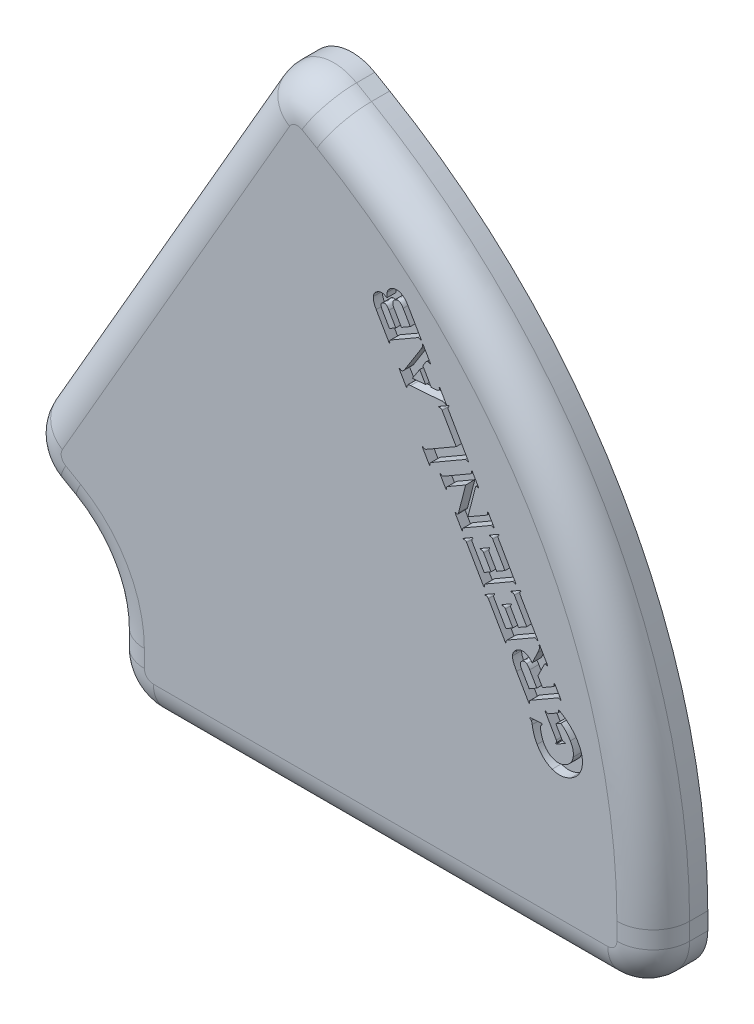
from build123d import *

# Parameters (mm, degrees)
BOSS_EXTRUDE1_DEPTH = 3
FILLET1_R           = 2.5
FILLET2_R           = 5
FILLET3_R           = 35
FILLET4_R           = 2
CUT_EXTRUDE1_DEPTH  = 0.5


with BuildPart() as part:
    # Sketch1 → Boss-Extrude1 (new body)
    with BuildSketch(Plane.XY.offset(3)):
        Polygon((14.999999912, -14.999999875), (14.999999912, 8.660317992), (-5.490385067, 20.490372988), (-20.490382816, -5.490381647), (-15.000000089, -8.660251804), (-15.000000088, -14.999999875), align=None)
    extrude(amount=-BOSS_EXTRUDE1_DEPTH)

    # Fillet1
    fillet1_edges = [part.edges().sort_by_distance(p)[0] for p in [
        (-15.000000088, -14.999999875, 1.5),
        (-20.490382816, -5.490381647, 1.5),
        (-5.490385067, 20.490372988, 1.5),
        (14.999999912, -14.999999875, 1.5),
    ]]
    fillet(fillet1_edges, radius=FILLET1_R)

    # Fillet2
    fillet2_edges = [part.edges().sort_by_distance(p)[0] for p in [
        (-15.000000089, -8.660251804, 1.5),
    ]]
    fillet(fillet2_edges, radius=FILLET2_R)

    # Fillet3
    fillet3_edges = [part.edges().sort_by_distance(p)[0] for p in [
        (14.999999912, 8.660317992, 1.5),
    ]]
    fillet(fillet3_edges, radius=FILLET3_R)

    # Fillet4
    fillet4_edges = [part.edges().sort_by_distance(p)[0] for p in [
        (-8.8e-08, -14.999999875, 3),
        (14.999999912, -12.023502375, 3),
        (-12.990381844, 7.499999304, 3),
        (-17.91265987, -6.978628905, 3),
        (-14.267767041, -14.267766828, 3),
        (14.267766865, -14.267766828, 3),
        (-19.490132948, -5.222365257, 3),
        (-5.222369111, 19.490129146, 3),
        (-15.000000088, -12.023502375, 3),
        (-15.669873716, -9.047003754, 3),
        (-2.912703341, 19.002157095, 3),
        (10.310865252, 5.953036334, 3),
    ]]
    fillet(fillet4_edges, radius=FILLET4_R)

    # Sketch2 → Cut-Extrude1 (cut)
    # profile 1 of 8: a face of its own
    with BuildSketch(Plane.XY.offset(3)):
        with BuildLine():
            add(Edge.make_bspline(
                [(0.346188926, 11.832705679), (0.344209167, 11.8589149), (0.340471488, 11.908396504), (0.34051095, 11.978529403), (0.34448693, 12.040230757), (0.352312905, 12.07780714), (0.355954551, 12.095292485)],
                knots=[0, 0, 0, 0, 1.194992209, 2.256081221, 3.188505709, 4, 4, 4, 4], degree=3))
            add(Edge.make_bspline(
                [(0.355954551, 12.095292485), (0.359679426, 12.111162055), (0.367063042, 12.142619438), (0.385747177, 12.18722046), (0.407739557, 12.229862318), (0.435149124, 12.269702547), (0.46737598, 12.306615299), (0.504200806, 12.341216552), (0.545868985, 12.373154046), (0.576404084, 12.391789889), (0.591957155, 12.401282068)],
                knots=[0, 0, 0, 0, 0.979892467, 1.942387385, 2.901921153, 3.865401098, 4.845716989, 5.84715339, 6.903446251, 8, 8, 8, 8], degree=3))
            add(Edge.make_bspline(
                [(0.591957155, 12.401282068), (0.613430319, 12.412962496), (0.655391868, 12.435787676), (0.720899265, 12.461451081), (0.786502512, 12.478451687), (0.851896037, 12.487191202), (0.917028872, 12.488030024), (0.981836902, 12.479357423), (1.04667008, 12.463431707), (1.0883811, 12.446313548), (1.10953528, 12.437631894)],
                knots=[0, 0, 0, 0, 1.084995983, 2.120233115, 3.115816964, 4.0882861, 5.044225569, 5.999726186, 6.985540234, 8, 8, 8, 8], degree=3))
            add(Edge.make_bspline(
                [(1.10953528, 12.437631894), (1.128391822, 12.428454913), (1.166663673, 12.409829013), (1.220791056, 12.373680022), (1.274285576, 12.332761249), (1.325283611, 12.284245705), (1.375365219, 12.230199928), (1.422934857, 12.168773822), (1.469718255, 12.101724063), (1.498459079, 12.053701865), (1.513181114, 12.029103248)],
                knots=[0, 0, 0, 0, 0.861570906, 1.748672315, 2.671085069, 3.628806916, 4.639478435, 5.698894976, 6.821295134, 8, 8, 8, 8], degree=3))
            Line((1.513181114, 12.029103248), (2.244517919, 10.762827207))
            Line((2.244517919, 10.762827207), (2.209795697, 10.742753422))
            add(Edge.make_bspline(
                [(2.209795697, 10.742753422), (2.202156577, 10.750134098), (2.187831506, 10.763974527), (2.165588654, 10.781307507), (2.143529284, 10.792980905), (2.122004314, 10.799940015), (2.100149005, 10.801475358), (2.077785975, 10.798795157), (2.054481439, 10.790632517), (2.039339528, 10.782746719), (2.031301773, 10.778560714)],
                knots=[0, 0, 0, 0, 1.270161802, 2.381839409, 3.358928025, 4.241437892, 5.065851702, 5.959161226, 6.916664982, 8, 8, 8, 8], degree=3))
            Line((2.031301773, 10.778560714), (0.566458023, 9.932749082))
            add(Edge.make_bspline(
                [(0.566458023, 9.932749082), (0.558936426, 9.927847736), (0.544759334, 9.918609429), (0.526149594, 9.902952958), (0.512966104, 9.885184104), (0.503645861, 9.866093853), (0.499591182, 9.844319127), (0.498599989, 9.819494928), (0.501480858, 9.790870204), (0.506005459, 9.770848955), (0.508406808, 9.76022304)],
                knots=[0, 0, 0, 0, 1.077921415, 2.03172136, 2.900158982, 3.715982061, 4.559082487, 5.537039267, 6.692828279, 8, 8, 8, 8], degree=3))
            Line((0.508406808, 9.76022304), (0.473684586, 9.740149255))
            Line((0.473684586, 9.740149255), (-0.240833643, 10.977670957))
            add(Edge.make_bspline(
                [(-0.240833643, 10.977670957), (-0.255559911, 11.004119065), (-0.283981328, 11.055163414), (-0.321064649, 11.131513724), (-0.351838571, 11.204296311), (-0.374447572, 11.274345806), (-0.3919752, 11.34051181), (-0.401537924, 11.403593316), (-0.405729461, 11.46347079), (-0.402107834, 11.501952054), (-0.400338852, 11.520748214)],
                knots=[0, 0, 0, 0, 1.262450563, 2.43650574, 3.53900008, 4.55520189, 5.504738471, 6.390241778, 7.213714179, 8, 8, 8, 8], degree=3))
            add(Edge.make_bspline(
                [(-0.400338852, 11.520748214), (-0.397328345, 11.539644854), (-0.391434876, 11.576637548), (-0.375468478, 11.629886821), (-0.353572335, 11.679506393), (-0.326296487, 11.726091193), (-0.293059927, 11.769252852), (-0.253445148, 11.808280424), (-0.208765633, 11.844649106), (-0.175445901, 11.8650895), (-0.158368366, 11.875565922)],
                knots=[0, 0, 0, 0, 1.028227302, 2.01289216, 2.979670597, 3.938786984, 4.909519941, 5.899836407, 6.923592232, 8, 8, 8, 8], degree=3))
            add(Edge.make_bspline(
                [(-0.158368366, 11.875565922), (-0.138020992, 11.88646551), (-0.099094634, 11.907317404), (-0.038350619, 11.928143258), (0.020673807, 11.93978143), (0.079757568, 11.939661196), (0.140331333, 11.928259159), (0.205148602, 11.907428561), (0.27472493, 11.874600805), (0.321453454, 11.847206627), (0.346188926, 11.832705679)],
                knots=[0, 0, 0, 0, 1.027134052, 1.964999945, 2.850141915, 3.69630986, 4.580019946, 5.586717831, 6.722543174, 8, 8, 8, 8], degree=3))
        make_face()
        with BuildLine():
            Line((0.832842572, 10.641841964), (0.454695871, 11.296138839))
            add(Edge.make_bspline(
                [(0.454695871, 11.296138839), (0.440373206, 11.31966924), (0.413882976, 11.363189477), (0.372666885, 11.42045895), (0.331931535, 11.463083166), (0.291941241, 11.493000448), (0.250155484, 11.50848201), (0.206623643, 11.512186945), (0.161210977, 11.501103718), (0.1325141, 11.486660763), (0.117239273, 11.47897304)],
                knots=[0, 0, 0, 0, 1.504565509, 2.782742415, 3.844473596, 4.71599428, 5.484793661, 6.247669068, 7.067266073, 8, 8, 8, 8], degree=3))
            add(Edge.make_bspline(
                [(0.117239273, 11.47897304), (0.103064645, 11.469776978), (0.076300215, 11.452413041), (0.044455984, 11.418707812), (0.025176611, 11.379747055), (0.0180124, 11.336075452), (0.023544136, 11.286774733), (0.041159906, 11.230510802), (0.06912688, 11.165333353), (0.094005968, 11.120313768), (0.107473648, 11.095943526)],
                knots=[0, 0, 0, 0, 0.921957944, 1.740834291, 2.501514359, 3.26399212, 4.127962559, 5.188851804, 6.478254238, 8, 8, 8, 8], degree=3))
            Line((0.107473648, 11.095943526), (0.48562035, 10.441646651))
            Line((0.48562035, 10.441646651), (0.832842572, 10.641841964))
        make_face(mode=Mode.SUBTRACT)
        with BuildLine():
            Line((1.631453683, 11.102996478), (1.239743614, 11.78116488))
            add(Edge.make_bspline(
                [(1.239743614, 11.78116488), (1.224257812, 11.806536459), (1.195176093, 11.854183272), (1.145036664, 11.915227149), (1.093279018, 11.96209412), (1.039035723, 11.994492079), (0.982290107, 12.01149252), (0.923671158, 12.012921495), (0.863649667, 11.999526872), (0.826320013, 11.980116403), (0.806800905, 11.969966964)],
                knots=[0, 0, 0, 0, 1.32586928, 2.489929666, 3.513828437, 4.429211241, 5.287664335, 6.127732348, 7.021019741, 8, 8, 8, 8], degree=3))
            add(Edge.make_bspline(
                [(0.806800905, 11.969966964), (0.78806006, 11.958133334), (0.75247483, 11.935663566), (0.711120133, 11.890079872), (0.682576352, 11.838961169), (0.66990365, 11.781122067), (0.670322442, 11.718082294), (0.684886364, 11.649720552), (0.712693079, 11.575717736), (0.73940301, 11.526757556), (0.753632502, 11.500674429)],
                knots=[0, 0, 0, 0, 0.985570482, 1.871407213, 2.716839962, 3.570750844, 4.483125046, 5.512375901, 6.674739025, 8, 8, 8, 8], degree=3))
            Line((0.753632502, 11.500674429), (1.145342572, 10.822506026))
            Line((1.145342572, 10.822506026), (1.631453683, 11.102996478))
        make_face(mode=Mode.SUBTRACT)
    # profile 2 of 8: a face of its own
    with BuildSketch(Plane.XY.offset(3)):
        with BuildLine():
            Line((2.323728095, 9.582856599), (2.785425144, 8.783160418))
            Line((2.785425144, 8.783160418), (3.042586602, 8.804319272))
            add(Edge.make_bspline(
                [(3.042586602, 8.804319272), (3.056914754, 8.805870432), (3.083558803, 8.808754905), (3.11996463, 8.816467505), (3.150388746, 8.825184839), (3.167636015, 8.833581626), (3.175507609, 8.83741389)],
                knots=[0, 0, 0, 0, 1.254135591, 2.332139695, 3.238794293, 4, 4, 4, 4], degree=3))
            add(Edge.make_bspline(
                [(3.175507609, 8.83741389), (3.181605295, 8.841392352), (3.193385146, 8.849078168), (3.208503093, 8.863296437), (3.219506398, 8.880103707), (3.227279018, 8.898665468), (3.230883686, 8.919355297), (3.231481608, 8.94168896), (3.227896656, 8.965928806), (3.223432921, 8.982315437), (3.221080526, 8.990951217)],
                knots=[0, 0, 0, 0, 0.996004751, 1.924137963, 2.816916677, 3.727375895, 4.659793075, 5.675305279, 6.774882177, 8, 8, 8, 8], degree=3))
            Line((3.221080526, 8.990951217), (3.255802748, 9.011025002))
            Line((3.255802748, 9.011025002), (3.626896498, 8.36866389))
            Line((3.626896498, 8.36866389), (3.592174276, 8.348590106))
            add(Edge.make_bspline(
                [(3.592174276, 8.348590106), (3.584976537, 8.357118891), (3.571405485, 8.373199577), (3.548809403, 8.392890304), (3.52663627, 8.408135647), (3.502718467, 8.417817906), (3.47547095, 8.423967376), (3.442318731, 8.426727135), (3.40189696, 8.427161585), (3.372622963, 8.425466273), (3.356714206, 8.424544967)],
                knots=[0, 0, 0, 0, 1.0241798, 1.931050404, 2.747002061, 3.484717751, 4.287012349, 5.305783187, 6.535845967, 8, 8, 8, 8], degree=3))
            Line((3.356714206, 8.424544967), (1.657495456, 8.308442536))
            add(Edge.make_bspline(
                [(1.657495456, 8.308442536), (1.642251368, 8.307171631), (1.613169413, 8.304747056), (1.572587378, 8.295749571), (1.53644274, 8.284811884), (1.51522784, 8.274018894), (1.505043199, 8.268837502)],
                knots=[0, 0, 0, 0, 1.155103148, 2.203651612, 3.137626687, 4, 4, 4, 4], degree=3))
            add(Edge.make_bspline(
                [(1.505043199, 8.268837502), (1.495079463, 8.26173502), (1.475090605, 8.247486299), (1.457650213, 8.212144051), (1.449539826, 8.169523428), (1.45245426, 8.138657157), (1.454044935, 8.121810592)],
                knots=[0, 0, 0, 0, 0.876646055, 1.75869295, 2.776712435, 4, 4, 4, 4], degree=3))
            Line((1.454044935, 8.121810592), (1.419322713, 8.101736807))
            Line((1.419322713, 8.101736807), (1.020559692, 8.792383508))
            Line((1.020559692, 8.792383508), (1.055281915, 8.812457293))
            add(Edge.make_bspline(
                [(1.055281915, 8.812457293), (1.068969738, 8.802859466), (1.094217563, 8.785155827), (1.136244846, 8.770650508), (1.177850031, 8.771345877), (1.202018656, 8.782434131), (1.214244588, 8.788043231)],
                knots=[0, 0, 0, 0, 1.167210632, 2.152974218, 3.065664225, 4, 4, 4, 4], degree=3))
            add(Edge.make_bspline(
                [(1.214244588, 8.788043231), (1.223295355, 8.794132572), (1.242447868, 8.807018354), (1.269136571, 8.832910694), (1.296240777, 8.864745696), (1.312533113, 8.88947729), (1.321123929, 8.902518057)],
                knots=[0, 0, 0, 0, 0.827633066, 1.751371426, 2.814316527, 4, 4, 4, 4], degree=3))
            Line((1.321123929, 8.902518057), (2.21630622, 10.317448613))
            add(Edge.make_bspline(
                [(2.21630622, 10.317448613), (2.227296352, 10.335450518), (2.247311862, 10.368236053), (2.272610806, 10.413878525), (2.290351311, 10.451108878), (2.301433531, 10.482121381), (2.30641694, 10.510612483), (2.304557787, 10.540099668), (2.299340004, 10.572240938), (2.292218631, 10.594039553), (2.288463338, 10.60553455)],
                knots=[0, 0, 0, 0, 1.626172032, 2.96162641, 4.022219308, 4.802727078, 5.495044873, 6.234619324, 7.069067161, 8, 8, 8, 8], degree=3))
            Line((2.288463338, 10.60553455), (2.32318556, 10.625608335))
            Line((2.32318556, 10.625608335), (2.754500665, 9.879080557))
            Line((2.754500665, 9.879080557), (2.719778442, 9.859006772))
            add(Edge.make_bspline(
                [(2.719778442, 9.859006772), (2.71320978, 9.866347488), (2.7008346, 9.880177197), (2.681348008, 9.89825449), (2.66081909, 9.91064265), (2.640615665, 9.919968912), (2.619715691, 9.923907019), (2.59892319, 9.922363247), (2.577844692, 9.917830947), (2.564843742, 9.910890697), (2.558103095, 9.907292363)],
                knots=[0, 0, 0, 0, 1.269668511, 2.392020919, 3.407178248, 4.346494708, 5.246852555, 6.110269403, 7.02022494, 8, 8, 8, 8], degree=3))
            add(Edge.make_bspline(
                [(2.558103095, 9.907292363), (2.549398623, 9.901584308), (2.530617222, 9.889268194), (2.505022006, 9.863635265), (2.47871399, 9.831834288), (2.46256158, 9.807460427), (2.453936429, 9.79444514)],
                knots=[0, 0, 0, 0, 0.804698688, 1.736276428, 2.791204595, 4, 4, 4, 4], degree=3))
            Line((2.453936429, 9.79444514), (2.323728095, 9.582856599))
        make_face()
        Polygon((2.151744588, 9.319184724), (1.751896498, 8.706120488), (2.474552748, 8.76037396), align=None, mode=Mode.SUBTRACT)
    # profile 3 of 8: a face of its own
    with BuildSketch(Plane.XY.offset(3)):
        with BuildLine():
            Line((4.158038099, 6.646470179), (3.383298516, 7.988158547))
            add(Edge.make_bspline(
                [(3.383298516, 7.988158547), (3.378397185, 7.99568), (3.369158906, 8.00985682), (3.353502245, 8.028468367), (3.335734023, 8.04164587), (3.316641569, 8.050986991), (3.29487568, 8.054957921), (3.270149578, 8.056328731), (3.241815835, 8.051683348), (3.221948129, 8.047057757), (3.211315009, 8.044582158)],
                knots=[0, 0, 0, 0, 1.079559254, 2.034808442, 2.904565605, 3.721628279, 4.566009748, 5.545452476, 6.686335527, 8, 8, 8, 8], degree=3))
            Line((3.211315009, 8.044582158), (3.191241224, 8.07930438))
            Line((3.191241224, 8.07930438), (3.74679678, 8.400484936))
            Line((3.74679678, 8.400484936), (3.766870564, 8.365762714))
            add(Edge.make_bspline(
                [(3.766870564, 8.365762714), (3.759484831, 8.357755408), (3.745695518, 8.342805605), (3.728540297, 8.31986246), (3.716257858, 8.298296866), (3.709098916, 8.277278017), (3.707585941, 8.256285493), (3.710435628, 8.234500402), (3.718439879, 8.211532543), (3.726331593, 8.196391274), (3.730520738, 8.188353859)],
                knots=[0, 0, 0, 0, 1.309722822, 2.445279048, 3.438336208, 4.284481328, 5.091995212, 5.947318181, 6.910378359, 8, 8, 8, 8], degree=3))
            Line((3.730520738, 8.188353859), (4.845972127, 6.256930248))
            Line((4.845972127, 6.256930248), (4.811249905, 6.236856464))
            add(Edge.make_bspline(
                [(4.811249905, 6.236856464), (4.803259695, 6.244434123), (4.788417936, 6.258509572), (4.765505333, 6.275846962), (4.743637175, 6.28737963), (4.722783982, 6.294646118), (4.701755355, 6.296172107), (4.680098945, 6.293137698), (4.657033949, 6.286107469), (4.642210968, 6.278019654), (4.634383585, 6.273748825)],
                knots=[0, 0, 0, 0, 1.327910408, 2.466584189, 3.452040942, 4.300509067, 5.110239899, 5.96791107, 6.926940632, 8, 8, 8, 8], degree=3))
            Line((4.634383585, 6.273748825), (2.784340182, 5.204955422))
            add(Edge.make_bspline(
                [(2.784340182, 5.204955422), (2.776798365, 5.200266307), (2.762507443, 5.191380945), (2.744030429, 5.175691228), (2.73099322, 5.15803589), (2.721485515, 5.139263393), (2.717167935, 5.117611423), (2.71806381, 5.092777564), (2.720185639, 5.064100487), (2.725233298, 5.044130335), (2.727916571, 5.03351445)],
                knots=[0, 0, 0, 0, 1.069591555, 2.026759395, 2.898263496, 3.697307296, 4.543384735, 5.523826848, 6.683696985, 8, 8, 8, 8], degree=3))
            Line((2.727916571, 5.03351445), (2.693194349, 5.013440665))
            Line((2.693194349, 5.013440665), (2.292261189, 5.707885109))
            Line((2.292261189, 5.707885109), (2.326983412, 5.727958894))
            add(Edge.make_bspline(
                [(2.326983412, 5.727958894), (2.334787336, 5.720373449), (2.349260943, 5.706305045), (2.371886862, 5.688962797), (2.393374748, 5.676800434), (2.414545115, 5.669630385), (2.435980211, 5.66793865), (2.457910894, 5.67180829), (2.481207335, 5.678651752), (2.496025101, 5.686776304), (2.503849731, 5.691066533)],
                knots=[0, 0, 0, 0, 1.308080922, 2.426042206, 3.418950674, 4.264969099, 5.094042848, 5.973778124, 6.930038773, 8, 8, 8, 8], degree=3))
            Line((2.503849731, 5.691066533), (4.158038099, 6.646470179))
        make_face()
    # profile 4 of 8: a face of its own
    with BuildSketch(Plane.XY.offset(3)):
        with BuildLine():
            Line((4.804197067, 3.626694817), (5.819822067, 4.213174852))
            add(Edge.make_bspline(
                [(5.819822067, 4.213174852), (5.827343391, 4.2180758), (5.841733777, 4.227452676), (5.860518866, 4.243317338), (5.873940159, 4.261512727), (5.883788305, 4.281027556), (5.888375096, 4.303369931), (5.889291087, 4.328423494), (5.88642973, 4.356684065), (5.88190506, 4.376341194), (5.879500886, 4.386785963)],
                knots=[0, 0, 0, 0, 1.069398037, 2.046055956, 2.907626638, 3.745722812, 4.628832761, 5.599056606, 6.724264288, 8, 8, 8, 8], degree=3))
            Line((5.879500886, 4.386785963), (5.914223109, 4.406859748))
            Line((5.914223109, 4.406859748), (6.254934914, 3.81658197))
            Line((6.254934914, 3.81658197), (6.220212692, 3.796508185))
            add(Edge.make_bspline(
                [(6.220212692, 3.796508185), (6.212573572, 3.803888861), (6.198248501, 3.81772929), (6.176005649, 3.83506227), (6.153946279, 3.846735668), (6.132421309, 3.853694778), (6.110566, 3.855230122), (6.08820297, 3.852549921), (6.064898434, 3.84438728), (6.049756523, 3.836501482), (6.041718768, 3.832315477)],
                knots=[0, 0, 0, 0, 1.270161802, 2.381839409, 3.358928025, 4.241437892, 5.065851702, 5.959161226, 6.916664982, 8, 8, 8, 8], degree=3))
            Line((6.041718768, 3.832315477), (4.576875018, 2.986503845))
            add(Edge.make_bspline(
                [(4.576875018, 2.986503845), (4.569353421, 2.981602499), (4.555176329, 2.972364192), (4.536566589, 2.956707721), (4.523383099, 2.938938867), (4.514062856, 2.919848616), (4.510008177, 2.89807389), (4.509016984, 2.873249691), (4.511897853, 2.844624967), (4.516422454, 2.824603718), (4.518823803, 2.813977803)],
                knots=[0, 0, 0, 0, 1.077921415, 2.03172136, 2.900158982, 3.715982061, 4.559082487, 5.537039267, 6.692828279, 8, 8, 8, 8], degree=3))
            Line((4.518823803, 2.813977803), (4.484101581, 2.793904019))
            Line((4.484101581, 2.793904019), (4.090221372, 3.476412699))
            Line((4.090221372, 3.476412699), (4.124943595, 3.496486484))
            add(Edge.make_bspline(
                [(4.124943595, 3.496486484), (4.133952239, 3.487650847), (4.149983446, 3.471927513), (4.177199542, 3.4570532), (4.204336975, 3.452248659), (4.219833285, 3.458982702), (4.227482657, 3.462306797)],
                knots=[0, 0, 0, 0, 1.290703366, 2.296853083, 3.159283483, 4, 4, 4, 4], degree=3))
            add(Edge.make_bspline(
                [(4.227482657, 3.462306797), (4.233977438, 3.466845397), (4.247984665, 3.476633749), (4.263037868, 3.50056472), (4.277482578, 3.530042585), (4.28410311, 3.552936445), (4.287704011, 3.565388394)],
                knots=[0, 0, 0, 0, 0.771714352, 1.664348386, 2.729641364, 4, 4, 4, 4], degree=3))
            Line((4.287704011, 3.565388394), (4.68158422, 5.083943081))
            Line((4.68158422, 5.083943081), (3.69471356, 4.514281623))
            add(Edge.make_bspline(
                [(3.69471356, 4.514281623), (3.687180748, 4.509389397), (3.672982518, 4.50016828), (3.654429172, 4.48432583), (3.640686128, 4.466763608), (3.6308985, 4.447680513), (3.625877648, 4.425758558), (3.625906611, 4.400788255), (3.629251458, 4.372213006), (3.63407693, 4.352381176), (3.636662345, 4.341755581)],
                knots=[0, 0, 0, 0, 1.073417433, 2.023232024, 2.901183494, 3.723036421, 4.567333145, 5.562098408, 6.693809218, 8, 8, 8, 8], degree=3))
            Line((3.636662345, 4.341755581), (3.601940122, 4.321681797))
            Line((3.601940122, 4.321681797), (3.260685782, 4.911959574))
            Line((3.260685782, 4.911959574), (3.295408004, 4.932033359))
            add(Edge.make_bspline(
                [(3.295408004, 4.932033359), (3.303397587, 4.924453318), (3.318238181, 4.910373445), (3.341158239, 4.893064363), (3.363156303, 4.881364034), (3.384433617, 4.874290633), (3.406018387, 4.872582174), (3.428068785, 4.876281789), (3.451148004, 4.883977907), (3.466055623, 4.892002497), (3.473901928, 4.896226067)],
                knots=[0, 0, 0, 0, 1.315771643, 2.444036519, 3.420484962, 4.281782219, 5.105655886, 5.979873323, 6.936749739, 8, 8, 8, 8], degree=3))
            Line((3.473901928, 4.896226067), (4.937118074, 5.74095263))
            add(Edge.make_bspline(
                [(4.937118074, 5.74095263), (4.944602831, 5.745894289), (4.958824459, 5.75528383), (4.977994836, 5.770536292), (4.991052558, 5.78867499), (5.001110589, 5.807675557), (5.00573931, 5.829878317), (5.006589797, 5.854937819), (5.003639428, 5.883718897), (4.999194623, 5.903755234), (4.996796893, 5.914563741)],
                knots=[0, 0, 0, 0, 1.0681569, 2.029582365, 2.890153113, 3.707978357, 4.569086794, 5.559678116, 6.683579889, 8, 8, 8, 8], degree=3))
            Line((4.996796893, 5.914563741), (5.031519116, 5.934637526))
            Line((5.031519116, 5.934637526), (5.399357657, 5.297701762))
            Line((5.399357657, 5.297701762), (5.364635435, 5.277627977))
            add(Edge.make_bspline(
                [(5.364635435, 5.277627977), (5.3561453, 5.286531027), (5.340985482, 5.302428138), (5.31526799, 5.318975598), (5.288549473, 5.323298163), (5.273364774, 5.317051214), (5.265894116, 5.313977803)],
                knots=[0, 0, 0, 0, 1.289593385, 2.30267275, 3.164938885, 4, 4, 4, 4], degree=3))
            add(Edge.make_bspline(
                [(5.265894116, 5.313977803), (5.258685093, 5.308449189), (5.242888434, 5.296334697), (5.231369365, 5.270858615), (5.221952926, 5.24379175), (5.212033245, 5.213257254), (5.201138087, 5.173056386), (5.192522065, 5.143247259), (5.187769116, 5.126803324)],
                knots=[0, 0, 0, 0, 0.781868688, 1.713257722, 2.366731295, 3.294374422, 4.507466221, 6, 6, 6, 6], degree=3))
            Line((5.187769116, 5.126803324), (4.804197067, 3.626694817))
        make_face()
    # profile 5 of 8: a face of its own
    with BuildSketch(Plane.XY.offset(3)):
        with BuildLine():
            Line((6.388398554, 1.821482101), (6.839787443, 2.081898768))
            Line((6.839787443, 2.081898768), (6.167586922, 3.245635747))
            add(Edge.make_bspline(
                [(6.167586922, 3.245635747), (6.162727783, 3.253374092), (6.153503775, 3.26806364), (6.137055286, 3.286972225), (6.119229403, 3.301183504), (6.099897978, 3.311104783), (6.077965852, 3.315972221), (6.053056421, 3.316684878), (6.024219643, 3.313904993), (6.004232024, 3.309032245), (5.993433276, 3.306399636)],
                knots=[0, 0, 0, 0, 1.078086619, 2.04651052, 2.943787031, 3.755659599, 4.589703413, 5.573084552, 6.68880582, 8, 8, 8, 8], degree=3))
            Line((5.993433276, 3.306399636), (5.973359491, 3.341121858))
            Line((5.973359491, 3.341121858), (6.494192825, 3.642228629))
            Line((6.494192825, 3.642228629), (6.514266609, 3.607506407))
            add(Edge.make_bspline(
                [(6.514266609, 3.607506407), (6.506781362, 3.599939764), (6.492717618, 3.585723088), (6.476600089, 3.562485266), (6.463873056, 3.540879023), (6.457127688, 3.518983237), (6.455318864, 3.497082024), (6.459131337, 3.474684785), (6.466727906, 3.451233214), (6.474773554, 3.435956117), (6.479001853, 3.427927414)],
                knots=[0, 0, 0, 0, 1.264087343, 2.375045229, 3.357651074, 4.2359404, 5.07787082, 5.948477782, 6.921845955, 8, 8, 8, 8], degree=3))
            Line((6.479001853, 3.427927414), (7.452851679, 1.741729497))
            Line((7.452851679, 1.741729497), (7.418129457, 1.721655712))
            add(Edge.make_bspline(
                [(7.418129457, 1.721655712), (7.410490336, 1.729036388), (7.396165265, 1.742876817), (7.373922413, 1.760209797), (7.351863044, 1.771883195), (7.330338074, 1.778842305), (7.308482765, 1.780377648), (7.286119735, 1.777697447), (7.262815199, 1.769534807), (7.247673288, 1.761649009), (7.239635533, 1.757463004)],
                knots=[0, 0, 0, 0, 1.270161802, 2.381839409, 3.358928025, 4.241437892, 5.065851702, 5.959161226, 6.916664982, 8, 8, 8, 8], degree=3))
            Line((7.239635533, 1.757463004), (5.774791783, 0.911651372))
            add(Edge.make_bspline(
                [(5.774791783, 0.911651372), (5.767270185, 0.906750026), (5.753093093, 0.897511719), (5.734483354, 0.881855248), (5.721299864, 0.864086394), (5.711979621, 0.844996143), (5.707924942, 0.823221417), (5.706933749, 0.798397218), (5.709814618, 0.769772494), (5.714339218, 0.749751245), (5.716740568, 0.73912533)],
                knots=[0, 0, 0, 0, 1.077921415, 2.03172136, 2.900158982, 3.715982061, 4.559082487, 5.537039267, 6.692828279, 8, 8, 8, 8], degree=3))
            Line((5.716740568, 0.73912533), (5.682018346, 0.719051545))
            Line((5.682018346, 0.719051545), (4.729869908, 2.367814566))
            add(Edge.make_bspline(
                [(4.729869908, 2.367814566), (4.725117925, 2.376001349), (4.716173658, 2.39141066), (4.698768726, 2.409826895), (4.681397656, 2.424798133), (4.661571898, 2.434326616), (4.639531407, 2.439135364), (4.614396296, 2.440118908), (4.585865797, 2.436394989), (4.56580889, 2.431996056), (4.555173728, 2.429663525)],
                knots=[0, 0, 0, 0, 1.106938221, 2.083499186, 2.958610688, 3.784462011, 4.63397532, 5.590023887, 6.722111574, 8, 8, 8, 8], degree=3))
            Line((4.555173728, 2.429663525), (4.535099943, 2.464385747))
            Line((4.535099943, 2.464385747), (5.055933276, 2.764949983))
            Line((5.055933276, 2.764949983), (5.076007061, 2.730227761))
            add(Edge.make_bspline(
                [(5.076007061, 2.730227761), (5.068344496, 2.722108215), (5.054162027, 2.707079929), (5.037780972, 2.683036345), (5.025186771, 2.661245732), (5.018827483, 2.639490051), (5.017646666, 2.617748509), (5.022096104, 2.595069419), (5.03001285, 2.570565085), (5.038817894, 2.554676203), (5.043454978, 2.54630849)],
                knots=[0, 0, 0, 0, 1.297281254, 2.401108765, 3.380695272, 4.213553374, 5.01467439, 5.89033718, 6.888968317, 8, 8, 8, 8], degree=3))
            Line((5.043454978, 2.54630849), (5.693954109, 1.420548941))
            Line((5.693954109, 1.420548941), (6.075898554, 1.640818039))
            Line((6.075898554, 1.640818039), (5.667369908, 2.348283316))
            add(Edge.make_bspline(
                [(5.667369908, 2.348283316), (5.662354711, 2.356399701), (5.652889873, 2.371717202), (5.635941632, 2.391085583), (5.617701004, 2.405550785), (5.598091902, 2.41591276), (5.575806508, 2.42131999), (5.550522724, 2.422648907), (5.521548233, 2.420330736), (5.501315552, 2.416159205), (5.490503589, 2.413930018)],
                knots=[0, 0, 0, 0, 1.105542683, 2.086415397, 2.967788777, 3.793471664, 4.638126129, 5.605216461, 6.720272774, 8, 8, 8, 8], degree=3))
            Line((5.490503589, 2.413930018), (5.470429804, 2.44865224))
            Line((5.470429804, 2.44865224), (5.991263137, 2.749759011))
            Line((5.991263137, 2.749759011), (6.011336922, 2.715036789))
            add(Edge.make_bspline(
                [(6.011336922, 2.715036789), (6.003858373, 2.707099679), (5.989765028, 2.692142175), (5.973616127, 2.668102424), (5.961743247, 2.645672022), (5.95452122, 2.623852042), (5.953577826, 2.601462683), (5.957873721, 2.578425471), (5.965937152, 2.553493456), (5.97502619, 2.537480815), (5.979869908, 2.528947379)],
                knots=[0, 0, 0, 0, 1.255913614, 2.366772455, 3.327673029, 4.178836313, 4.993429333, 5.88161685, 6.871074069, 8, 8, 8, 8], degree=3))
            Line((5.979869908, 2.528947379), (6.388398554, 1.821482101))
        make_face()
    # profile 6 of 8: a face of its own
    with BuildSketch(Plane.XY.offset(3)):
        with BuildLine():
            Line((7.586315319, -0.253370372), (8.037704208, 0.007046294))
            Line((8.037704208, 0.007046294), (7.365503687, 1.170783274))
            add(Edge.make_bspline(
                [(7.365503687, 1.170783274), (7.360644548, 1.178521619), (7.35142054, 1.193211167), (7.334972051, 1.212119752), (7.317146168, 1.22633103), (7.297814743, 1.23625231), (7.275882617, 1.241119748), (7.250973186, 1.241832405), (7.222136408, 1.239052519), (7.202148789, 1.234179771), (7.191350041, 1.231547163)],
                knots=[0, 0, 0, 0, 1.078086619, 2.04651052, 2.943787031, 3.755659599, 4.589703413, 5.573084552, 6.68880582, 8, 8, 8, 8], degree=3))
            Line((7.191350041, 1.231547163), (7.171276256, 1.266269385))
            Line((7.171276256, 1.266269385), (7.692109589, 1.567376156))
            Line((7.692109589, 1.567376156), (7.712183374, 1.532653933))
            add(Edge.make_bspline(
                [(7.712183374, 1.532653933), (7.704698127, 1.52508729), (7.690634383, 1.510870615), (7.674516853, 1.487632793), (7.66178982, 1.466026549), (7.655044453, 1.444130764), (7.653235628, 1.422229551), (7.657048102, 1.399832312), (7.66464467, 1.37638074), (7.672690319, 1.361103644), (7.676918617, 1.35307494)],
                knots=[0, 0, 0, 0, 1.264087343, 2.375045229, 3.357651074, 4.2359404, 5.07787082, 5.948477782, 6.921845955, 8, 8, 8, 8], degree=3))
            Line((7.676918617, 1.35307494), (8.650768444, -0.333122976))
            Line((8.650768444, -0.333122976), (8.616046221, -0.353196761))
            add(Edge.make_bspline(
                [(8.616046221, -0.353196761), (8.608407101, -0.345816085), (8.59408203, -0.331975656), (8.571839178, -0.314642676), (8.549779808, -0.302969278), (8.528254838, -0.296010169), (8.50639953, -0.294474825), (8.4840365, -0.297155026), (8.460731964, -0.305317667), (8.445590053, -0.313203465), (8.437552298, -0.317389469)],
                knots=[0, 0, 0, 0, 1.270161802, 2.381839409, 3.358928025, 4.241437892, 5.065851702, 5.959161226, 6.916664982, 8, 8, 8, 8], degree=3))
            Line((8.437552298, -0.317389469), (6.972708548, -1.163201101))
            add(Edge.make_bspline(
                [(6.972708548, -1.163201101), (6.96518695, -1.168102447), (6.951009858, -1.177340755), (6.932400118, -1.192997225), (6.919216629, -1.210766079), (6.909896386, -1.22985633), (6.905841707, -1.251631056), (6.904850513, -1.276455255), (6.907731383, -1.305079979), (6.912255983, -1.325101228), (6.914657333, -1.335727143)],
                knots=[0, 0, 0, 0, 1.077921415, 2.03172136, 2.900158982, 3.715982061, 4.559082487, 5.537039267, 6.692828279, 8, 8, 8, 8], degree=3))
            Line((6.914657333, -1.335727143), (6.87993511, -1.355800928))
            Line((6.87993511, -1.355800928), (5.927786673, 0.292962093))
            add(Edge.make_bspline(
                [(5.927786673, 0.292962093), (5.92303469, 0.301148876), (5.914090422, 0.316558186), (5.896685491, 0.334974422), (5.879314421, 0.349945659), (5.859488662, 0.359474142), (5.837448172, 0.364282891), (5.81231306, 0.365266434), (5.783782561, 0.361542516), (5.763725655, 0.357143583), (5.753090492, 0.354811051)],
                knots=[0, 0, 0, 0, 1.106938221, 2.083499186, 2.958610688, 3.784462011, 4.63397532, 5.590023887, 6.722111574, 8, 8, 8, 8], degree=3))
            Line((5.753090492, 0.354811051), (5.733016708, 0.389533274))
            Line((5.733016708, 0.389533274), (6.253850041, 0.69009751))
            Line((6.253850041, 0.69009751), (6.273923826, 0.655375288))
            add(Edge.make_bspline(
                [(6.273923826, 0.655375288), (6.266261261, 0.647255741), (6.252078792, 0.632227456), (6.235697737, 0.608183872), (6.223103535, 0.586393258), (6.216744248, 0.564637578), (6.215563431, 0.542896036), (6.220012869, 0.520216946), (6.227929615, 0.495712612), (6.236734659, 0.479823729), (6.241371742, 0.471456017)],
                knots=[0, 0, 0, 0, 1.297281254, 2.401108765, 3.380695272, 4.213553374, 5.01467439, 5.89033718, 6.888968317, 8, 8, 8, 8], degree=3))
            Line((6.241371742, 0.471456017), (6.891870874, -0.654303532))
            Line((6.891870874, -0.654303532), (7.273815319, -0.434034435))
            Line((7.273815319, -0.434034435), (6.865286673, 0.273430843))
            add(Edge.make_bspline(
                [(6.865286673, 0.273430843), (6.860271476, 0.281547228), (6.850806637, 0.296864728), (6.833858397, 0.31623311), (6.815617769, 0.330698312), (6.796008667, 0.341060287), (6.773723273, 0.346467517), (6.748439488, 0.347796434), (6.719464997, 0.345478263), (6.699232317, 0.341306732), (6.688420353, 0.339077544)],
                knots=[0, 0, 0, 0, 1.105542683, 2.086415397, 2.967788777, 3.793471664, 4.638126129, 5.605216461, 6.720272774, 8, 8, 8, 8], degree=3))
            Line((6.688420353, 0.339077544), (6.668346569, 0.373799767))
            Line((6.668346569, 0.373799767), (7.189179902, 0.674906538))
            Line((7.189179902, 0.674906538), (7.209253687, 0.640184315))
            add(Edge.make_bspline(
                [(7.209253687, 0.640184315), (7.201775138, 0.632247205), (7.187681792, 0.617289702), (7.171532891, 0.59324995), (7.159660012, 0.570819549), (7.152437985, 0.548999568), (7.151494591, 0.526610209), (7.155790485, 0.503572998), (7.163853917, 0.478640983), (7.172942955, 0.462628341), (7.177786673, 0.454094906)],
                knots=[0, 0, 0, 0, 1.255913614, 2.366772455, 3.327673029, 4.178836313, 4.993429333, 5.88161685, 6.871074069, 8, 8, 8, 8], degree=3))
            Line((7.177786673, 0.454094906), (7.586315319, -0.253370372))
        make_face()
    # profile 7 of 8: a face of its own
    with BuildSketch(Plane.XY.offset(3)):
        with BuildLine():
            Line((8.905759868, -2.458500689), (9.479761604, -2.127011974))
            add(Edge.make_bspline(
                [(9.479761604, -2.127011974), (9.487499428, -2.122150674), (9.501971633, -2.113058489), (9.520532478, -2.09701851), (9.534443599, -2.079643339), (9.543572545, -2.06010211), (9.548407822, -2.038299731), (9.549222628, -2.013194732), (9.546219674, -1.984480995), (9.54215398, -1.96421996), (9.539982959, -1.953400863)],
                knots=[0, 0, 0, 0, 1.085838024, 2.030864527, 2.904390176, 3.71270898, 4.573695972, 5.542657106, 6.687814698, 8, 8, 8, 8], degree=3))
            Line((9.539982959, -1.953400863), (9.574705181, -1.933327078))
            Line((9.574705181, -1.933327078), (9.935490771, -2.558327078))
            Line((9.935490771, -2.558327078), (9.900768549, -2.578400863))
            add(Edge.make_bspline(
                [(9.900768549, -2.578400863), (9.893129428, -2.571020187), (9.878804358, -2.557179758), (9.856561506, -2.539846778), (9.834502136, -2.52817338), (9.812977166, -2.52121427), (9.791121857, -2.519678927), (9.768758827, -2.522359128), (9.745454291, -2.530521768), (9.73031238, -2.538407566), (9.722274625, -2.542593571)],
                knots=[0, 0, 0, 0, 1.270161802, 2.381839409, 3.358928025, 4.241437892, 5.065851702, 5.959161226, 6.916664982, 8, 8, 8, 8], degree=3))
            Line((9.722274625, -2.542593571), (8.257430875, -3.388405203))
            add(Edge.make_bspline(
                [(8.257430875, -3.388405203), (8.249909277, -3.393306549), (8.235732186, -3.402544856), (8.217122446, -3.418201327), (8.203938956, -3.435970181), (8.194618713, -3.455060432), (8.190564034, -3.476835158), (8.189572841, -3.501659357), (8.19245371, -3.530284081), (8.19697831, -3.55030533), (8.19937966, -3.560931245)],
                knots=[0, 0, 0, 0, 1.077921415, 2.03172136, 2.900158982, 3.715982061, 4.559082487, 5.537039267, 6.692828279, 8, 8, 8, 8], degree=3))
            Line((8.19937966, -3.560931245), (8.164657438, -3.58100503))
            Line((8.164657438, -3.58100503), (7.482148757, -2.39882187))
            add(Edge.make_bspline(
                [(7.482148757, -2.39882187), (7.461399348, -2.362641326), (7.422418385, -2.294670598), (7.372549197, -2.197101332), (7.331159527, -2.11253552), (7.301723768, -2.037293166), (7.279791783, -1.968564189), (7.266670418, -1.902113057), (7.258277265, -1.836433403), (7.258508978, -1.792835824), (7.258624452, -1.771109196)],
                knots=[0, 0, 0, 0, 1.481694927, 2.783592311, 3.893076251, 4.825012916, 5.652242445, 6.452477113, 7.228800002, 8, 8, 8, 8], degree=3))
            add(Edge.make_bspline(
                [(7.258624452, -1.771109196), (7.260153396, -1.749497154), (7.263182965, -1.706673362), (7.278914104, -1.644614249), (7.302317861, -1.585671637), (7.334843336, -1.530512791), (7.375600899, -1.478639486), (7.424087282, -1.429511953), (7.48164462, -1.384196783), (7.52452794, -1.358150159), (7.546710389, -1.344676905)],
                knots=[0, 0, 0, 0, 0.963050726, 1.908264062, 2.836799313, 3.778645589, 4.748271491, 5.767449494, 6.845158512, 8, 8, 8, 8], degree=3))
            add(Edge.make_bspline(
                [(7.546710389, -1.344676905), (7.564111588, -1.335176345), (7.597942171, -1.316705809), (7.649826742, -1.294262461), (7.701091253, -1.277472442), (7.751444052, -1.265127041), (7.801355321, -1.259140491), (7.850430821, -1.258777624), (7.898925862, -1.262710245), (7.946725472, -1.273454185), (7.994389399, -1.289569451), (8.042747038, -1.310545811), (8.091061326, -1.33821127), (8.140368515, -1.370962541), (8.189868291, -1.4100042), (8.239989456, -1.454992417), (8.290918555, -1.505125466), (8.323642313, -1.541787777), (8.340438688, -1.560605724)],
                knots=[0, 0, 0, 0, 1.044617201, 2.030895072, 2.97437404, 3.885319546, 4.759049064, 5.616985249, 6.468756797, 7.317589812, 8.191735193, 9.117962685, 10.091024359, 11.122071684, 12.235648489, 13.410372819, 14.670802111, 16, 16, 16, 16], degree=3))
            Line((8.340438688, -1.560605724), (8.636120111, -0.939946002))
            add(Edge.make_bspline(
                [(8.636120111, -0.939946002), (8.648111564, -0.913825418), (8.670262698, -0.865574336), (8.697516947, -0.797479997), (8.717566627, -0.740416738), (8.729753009, -0.692116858), (8.736024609, -0.649327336), (8.734960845, -0.608664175), (8.730142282, -0.568317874), (8.721739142, -0.542708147), (8.71750032, -0.529789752)],
                knots=[0, 0, 0, 0, 1.604294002, 2.963521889, 4.093743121, 4.977713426, 5.741621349, 6.498895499, 7.242793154, 8, 8, 8, 8], degree=3))
            Line((8.71750032, -0.529789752), (8.752222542, -0.509715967))
            Line((8.752222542, -0.509715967), (9.202526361, -1.288795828))
            Line((9.202526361, -1.288795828), (9.167804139, -1.308869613))
            add(Edge.make_bspline(
                [(9.167804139, -1.308869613), (9.156770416, -1.29864268), (9.136928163, -1.2802513), (9.105062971, -1.261244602), (9.073202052, -1.254963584), (9.05536956, -1.26242948), (9.046818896, -1.26600937)],
                knots=[0, 0, 0, 0, 1.306211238, 2.348996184, 3.208345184, 4, 4, 4, 4], degree=3))
            add(Edge.make_bspline(
                [(9.046818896, -1.26600937), (9.040625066, -1.270656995), (9.02626401, -1.281433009), (9.007775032, -1.306567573), (8.988543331, -1.340446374), (8.976438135, -1.366625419), (8.969778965, -1.381026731)],
                knots=[0, 0, 0, 0, 0.660494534, 1.531427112, 2.642017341, 4, 4, 4, 4], degree=3))
            Line((8.969778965, -1.381026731), (8.654023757, -2.022845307))
            Line((8.654023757, -2.022845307), (8.905759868, -2.458500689))
        make_face()
        with BuildLine():
            Line((8.593259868, -2.639164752), (8.202634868, -1.963166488))
            add(Edge.make_bspline(
                [(8.202634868, -1.963166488), (8.188487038, -1.939449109), (8.16204553, -1.895122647), (8.120562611, -1.836430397), (8.080726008, -1.789521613), (8.051945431, -1.765715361), (8.038789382, -1.754833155)],
                knots=[0, 0, 0, 0, 1.242294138, 2.321778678, 3.232859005, 4, 4, 4, 4], degree=3))
            add(Edge.make_bspline(
                [(8.038789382, -1.754833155), (8.030122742, -1.74870909), (8.013366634, -1.736868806), (7.985412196, -1.724971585), (7.957142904, -1.717095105), (7.927592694, -1.714423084), (7.897340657, -1.716569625), (7.866476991, -1.724171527), (7.834501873, -1.735375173), (7.814029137, -1.74672905), (7.803329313, -1.752663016)],
                knots=[0, 0, 0, 0, 1.011012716, 1.954694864, 2.884999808, 3.804657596, 4.774540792, 5.767684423, 6.833307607, 8, 8, 8, 8], degree=3))
            add(Edge.make_bspline(
                [(7.803329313, -1.752663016), (7.785823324, -1.763920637), (7.753007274, -1.785023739), (7.714000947, -1.825132), (7.689792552, -1.870514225), (7.682073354, -1.911663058), (7.682880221, -1.946332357), (7.687630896, -1.975171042), (7.695170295, -2.006808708), (7.70689988, -2.040922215), (7.721613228, -2.077830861), (7.73953456, -2.117569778), (7.761385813, -2.159767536), (7.777560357, -2.188548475), (7.785968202, -2.20350937)],
                knots=[0, 0, 0, 0, 1.437500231, 2.694682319, 3.825529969, 4.947268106, 5.548148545, 6.218990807, 6.965744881, 7.796880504, 8.712576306, 9.715233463, 10.812333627, 12, 12, 12, 12], degree=3))
            Line((7.785968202, -2.20350937), (8.176593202, -2.879507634))
            Line((8.176593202, -2.879507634), (8.593259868, -2.639164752))
        make_face(mode=Mode.SUBTRACT)
    # profile 8 of 8: a face of its own
    with BuildSketch(Plane.XY.offset(3)):
        with BuildLine():
            Line((9.643064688, -3.816781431), (9.974010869, -4.389155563))
            add(Edge.make_bspline(
                [(9.974010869, -4.389155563), (9.979016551, -4.397282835), (9.988463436, -4.412620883), (10.005436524, -4.431746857), (10.022970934, -4.446432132), (10.042343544, -4.456504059), (10.06445039, -4.460234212), (10.089463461, -4.461542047), (10.118021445, -4.45771072), (10.138074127, -4.453328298), (10.148707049, -4.451004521)],
                knots=[0, 0, 0, 0, 1.117950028, 2.109830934, 2.984530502, 3.790963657, 4.635559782, 5.591158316, 6.722713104, 8, 8, 8, 8], degree=3))
            Line((10.148707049, -4.451004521), (10.168238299, -4.485726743))
            Line((10.168238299, -4.485726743), (9.647404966, -4.786833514))
            Line((9.647404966, -4.786833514), (9.627873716, -4.752111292))
            add(Edge.make_bspline(
                [(9.627873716, -4.752111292), (9.635667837, -4.743960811), (9.649993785, -4.72897986), (9.667215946, -4.705638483), (9.679638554, -4.684354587), (9.686066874, -4.663370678), (9.687887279, -4.642417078), (9.684156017, -4.62053101), (9.676332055, -4.597079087), (9.668103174, -4.581818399), (9.663681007, -4.573617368)],
                knots=[0, 0, 0, 0, 1.34297221, 2.468443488, 3.452681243, 4.264270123, 5.064612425, 5.936665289, 6.891172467, 8, 8, 8, 8], degree=3))
            Line((9.663681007, -4.573617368), (9.050074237, -3.511334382))
            Line((9.050074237, -3.511334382), (9.084796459, -3.491260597))
            add(Edge.make_bspline(
                [(9.084796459, -3.491260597), (9.092535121, -3.498766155), (9.107097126, -3.512889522), (9.130736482, -3.52862261), (9.151928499, -3.541643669), (9.173318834, -3.548445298), (9.194811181, -3.550022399), (9.217118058, -3.54712356), (9.240645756, -3.539353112), (9.25582304, -3.530956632), (9.263832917, -3.526525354)],
                knots=[0, 0, 0, 0, 1.283250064, 2.414718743, 3.381019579, 4.240983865, 5.063582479, 5.933507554, 6.9093997, 8, 8, 8, 8], degree=3))
            Line((9.263832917, -3.526525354), (9.720647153, -3.262853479))
            add(Edge.make_bspline(
                [(9.720647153, -3.262853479), (9.728395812, -3.258001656), (9.743104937, -3.248791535), (9.761583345, -3.232511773), (9.775989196, -3.215426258), (9.785036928, -3.196152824), (9.789131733, -3.174440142), (9.790259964, -3.149564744), (9.78661691, -3.120953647), (9.781799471, -3.100950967), (9.779240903, -3.090327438)],
                knots=[0, 0, 0, 0, 1.088899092, 2.067035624, 2.926127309, 3.736724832, 4.574424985, 5.546117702, 6.696730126, 8, 8, 8, 8], degree=3))
            Line((9.779240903, -3.090327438), (9.813963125, -3.070253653))
            add(Edge.make_bspline(
                [(9.813963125, -3.070253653), (9.870965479, -3.105082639), (9.983036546, -3.173559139), (10.141689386, -3.285217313), (10.288963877, -3.401674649), (10.424413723, -3.523533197), (10.548758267, -3.650061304), (10.661003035, -3.782262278), (10.763151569, -3.918786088), (10.821314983, -4.015202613), (10.850204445, -4.063092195)],
                knots=[0, 0, 0, 0, 1.104685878, 2.171898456, 3.206661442, 4.208522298, 5.183662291, 6.138519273, 7.07541229, 8, 8, 8, 8], degree=3))
            add(Edge.make_bspline(
                [(10.850204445, -4.063092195), (10.874099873, -4.106202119), (10.920872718, -4.190585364), (10.98000761, -4.319467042), (11.028330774, -4.4467898), (11.064558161, -4.572795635), (11.090686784, -4.697142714), (11.104706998, -4.81989057), (11.108038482, -4.941272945), (11.101071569, -5.021059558), (11.097600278, -5.060813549)],
                knots=[0, 0, 0, 0, 1.130783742, 2.213392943, 3.250915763, 4.253083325, 5.219199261, 6.163306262, 7.084860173, 8, 8, 8, 8], degree=3))
            add(Edge.make_bspline(
                [(11.097600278, -5.060813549), (11.094273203, -5.08527589), (11.08766148, -5.133888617), (11.072755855, -5.205172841), (11.05502057, -5.27468925), (11.032852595, -5.341747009), (11.006353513, -5.406520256), (10.977604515, -5.469682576), (10.943445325, -5.529771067), (10.906594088, -5.588404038), (10.865223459, -5.644444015), (10.82091693, -5.698977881), (10.772090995, -5.750744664), (10.719801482, -5.800445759), (10.663395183, -5.847759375), (10.603965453, -5.893471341), (10.540105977, -5.936342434), (10.49568414, -5.963056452), (10.473142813, -5.97661216)],
                knots=[0, 0, 0, 0, 1.027537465, 2.041971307, 3.029934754, 4.013268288, 4.979386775, 5.942772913, 6.900049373, 7.854597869, 8.824435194, 9.798122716, 10.778251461, 11.784831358, 12.79996349, 13.842045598, 14.90497195, 16, 16, 16, 16], degree=3))
            add(Edge.make_bspline(
                [(10.473142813, -5.97661216), (10.430536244, -5.999755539), (10.347175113, -6.045036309), (10.21714828, -6.096474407), (10.087466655, -6.1336155), (9.95722583, -6.154264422), (9.826822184, -6.160029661), (9.696335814, -6.149189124), (9.565612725, -6.124120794), (9.480923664, -6.095360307), (9.437986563, -6.080778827)],
                knots=[0, 0, 0, 0, 1.079465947, 2.11201002, 3.108255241, 4.079372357, 5.04321496, 6.009253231, 6.990697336, 8, 8, 8, 8], degree=3))
            add(Edge.make_bspline(
                [(9.437986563, -6.080778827), (9.397462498, -6.064230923), (9.315912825, -6.030930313), (9.1995378, -5.965648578), (9.088603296, -5.88747238), (8.982339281, -5.797294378), (8.880628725, -5.695142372), (8.784738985, -5.579675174), (8.692409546, -5.452886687), (8.637580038, -5.361115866), (8.609536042, -5.314177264)],
                knots=[0, 0, 0, 0, 0.911535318, 1.834352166, 2.773251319, 3.735939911, 4.735280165, 5.77322282, 6.861056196, 8, 8, 8, 8], degree=3))
            add(Edge.make_bspline(
                [(8.609536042, -5.314177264), (8.592406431, -5.283597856), (8.558553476, -5.223164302), (8.513823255, -5.130830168), (8.473802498, -5.039084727), (8.439610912, -4.945773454), (8.41003239, -4.847847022), (8.383254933, -4.742790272), (8.357932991, -4.629068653), (8.344261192, -4.549991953), (8.337183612, -4.509055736)],
                knots=[0, 0, 0, 0, 0.983541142, 1.943755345, 2.878147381, 3.791838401, 4.731111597, 5.747969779, 6.834174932, 8, 8, 8, 8], degree=3))
            add(Edge.make_bspline(
                [(8.337183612, -4.509055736), (8.333776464, -4.488935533), (8.327518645, -4.451981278), (8.316092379, -4.402237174), (8.30526581, -4.362462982), (8.294593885, -4.340944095), (8.289983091, -4.331646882)],
                knots=[0, 0, 0, 0, 1.328039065, 2.439174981, 3.32564723, 4, 4, 4, 4], degree=3))
            add(Edge.make_bspline(
                [(8.289983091, -4.331646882), (8.286267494, -4.325986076), (8.27837021, -4.313954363), (8.259748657, -4.299590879), (8.237233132, -4.285353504), (8.2195969, -4.278028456), (8.210230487, -4.274138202)],
                knots=[0, 0, 0, 0, 0.8069279, 1.71507802, 2.786502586, 4, 4, 4, 4], degree=3))
            Line((8.210230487, -4.274138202), (8.21294316, -4.226395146))
            Line((8.21294316, -4.226395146), (8.878633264, -4.18896025))
            Line((8.878633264, -4.18896025), (8.882431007, -4.247011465))
            add(Edge.make_bspline(
                [(8.882431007, -4.247011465), (8.875060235, -4.25152487), (8.861319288, -4.259938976), (8.844208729, -4.274363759), (8.829960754, -4.287085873), (8.820060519, -4.301015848), (8.813203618, -4.317116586), (8.80793046, -4.336631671), (8.804538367, -4.360704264), (8.802626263, -4.378119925), (8.801593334, -4.387527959)],
                knots=[0, 0, 0, 0, 1.204684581, 2.245830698, 3.1209328, 3.863601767, 4.609697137, 5.553171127, 6.67820987, 8, 8, 8, 8], degree=3))
            add(Edge.make_bspline(
                [(8.801593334, -4.387527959), (8.800282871, -4.411406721), (8.797468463, -4.462689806), (8.805968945, -4.544639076), (8.821817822, -4.636366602), (8.846597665, -4.734790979), (8.877154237, -4.835453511), (8.91363507, -4.93219921), (8.953388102, -5.023764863), (8.984717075, -5.080922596), (9.000161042, -5.109099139)],
                knots=[0, 0, 0, 0, 0.756926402, 1.62560858, 2.602768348, 3.706540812, 4.839685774, 5.935167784, 6.982117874, 8, 8, 8, 8], degree=3))
            add(Edge.make_bspline(
                [(9.000161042, -5.109099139), (9.016329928, -5.136172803), (9.048086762, -5.189347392), (9.102826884, -5.26237275), (9.160278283, -5.329135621), (9.221958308, -5.388579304), (9.287251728, -5.44121427), (9.355734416, -5.488003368), (9.428775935, -5.526555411), (9.479750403, -5.547000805), (9.505260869, -5.55723282)],
                knots=[0, 0, 0, 0, 1.097078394, 2.154739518, 3.172196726, 4.160608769, 5.132013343, 6.088865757, 7.04356188, 8, 8, 8, 8], degree=3))
            add(Edge.make_bspline(
                [(9.505260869, -5.55723282), (9.534383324, -5.5667286), (9.591717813, -5.585423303), (9.679843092, -5.602225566), (9.767577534, -5.608872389), (9.855014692, -5.60509273), (9.941947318, -5.590615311), (10.028699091, -5.566521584), (10.115456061, -5.532445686), (10.170890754, -5.502152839), (10.199162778, -5.486703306)],
                knots=[0, 0, 0, 0, 1.018088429, 2.004349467, 2.975507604, 3.938884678, 4.908028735, 5.900416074, 6.929199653, 8, 8, 8, 8], degree=3))
            add(Edge.make_bspline(
                [(10.199162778, -5.486703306), (10.225749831, -5.47042234), (10.27793568, -5.438465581), (10.348681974, -5.38217447), (10.411102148, -5.320663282), (10.464667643, -5.25334129), (10.509827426, -5.180810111), (10.547154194, -5.103101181), (10.575717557, -5.019679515), (10.587205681, -4.961335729), (10.593042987, -4.931690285)],
                knots=[0, 0, 0, 0, 1.061179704, 2.082914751, 3.071731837, 4.040543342, 5.006314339, 5.976202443, 6.971674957, 8, 8, 8, 8], degree=3))
            add(Edge.make_bspline(
                [(10.593042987, -4.931690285), (10.597087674, -4.903897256), (10.605225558, -4.847977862), (10.606351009, -4.762617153), (10.599106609, -4.676201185), (10.583833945, -4.588875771), (10.56036581, -4.500429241), (10.527869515, -4.411125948), (10.487397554, -4.320542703), (10.454604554, -4.261429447), (10.437878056, -4.231277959)],
                knots=[0, 0, 0, 0, 0.91971409, 1.850458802, 2.790125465, 3.758733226, 4.752193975, 5.785250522, 6.870338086, 8, 8, 8, 8], degree=3))
            add(Edge.make_bspline(
                [(10.437878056, -4.231277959), (10.420076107, -4.201802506), (10.384585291, -4.143038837), (10.326311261, -4.058110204), (10.263435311, -3.976799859), (10.196567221, -3.899834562), (10.12776219, -3.828302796), (10.058615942, -3.763296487), (9.988500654, -3.70722855), (9.940405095, -3.674702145), (9.917044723, -3.658903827)],
                knots=[0, 0, 0, 0, 1.058555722, 2.110387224, 3.164728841, 4.217148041, 5.243510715, 6.215285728, 7.133150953, 8, 8, 8, 8], degree=3))
            Line((9.917044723, -3.658903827), (9.643064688, -3.816781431))
        make_face()
    extrude(amount=-CUT_EXTRUDE1_DEPTH, mode=Mode.SUBTRACT)


solid = part.part
